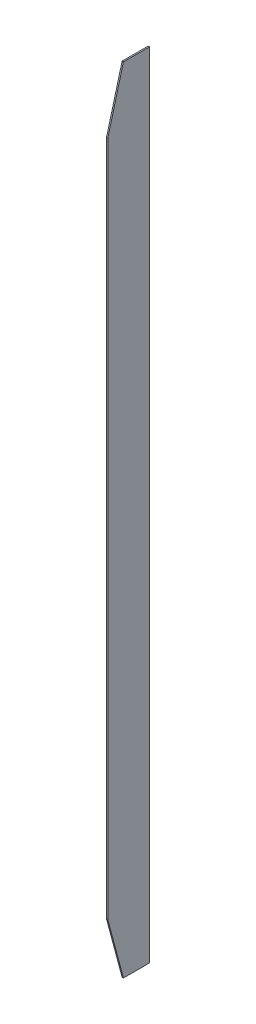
from build123d import *

# Parameters (mm, degrees)
BOSS_EXTRUDE2_DEPTH = 1.5875


with BuildPart() as part:
    # Sketch3 → Boss-Extrude2 (new, symmetric)
    with BuildSketch(Plane.YZ):
        Polygon((-964.415443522, 4270.855641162), (964.415443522, 4270.855641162), (964.415443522, 4334.355641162), (822.224307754, 4372.455641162), (-822.224307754, 4372.455641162), (-964.415443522, 4334.355641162), align=None)
    extrude(amount=BOSS_EXTRUDE2_DEPTH, both=True)


solid = part.part
